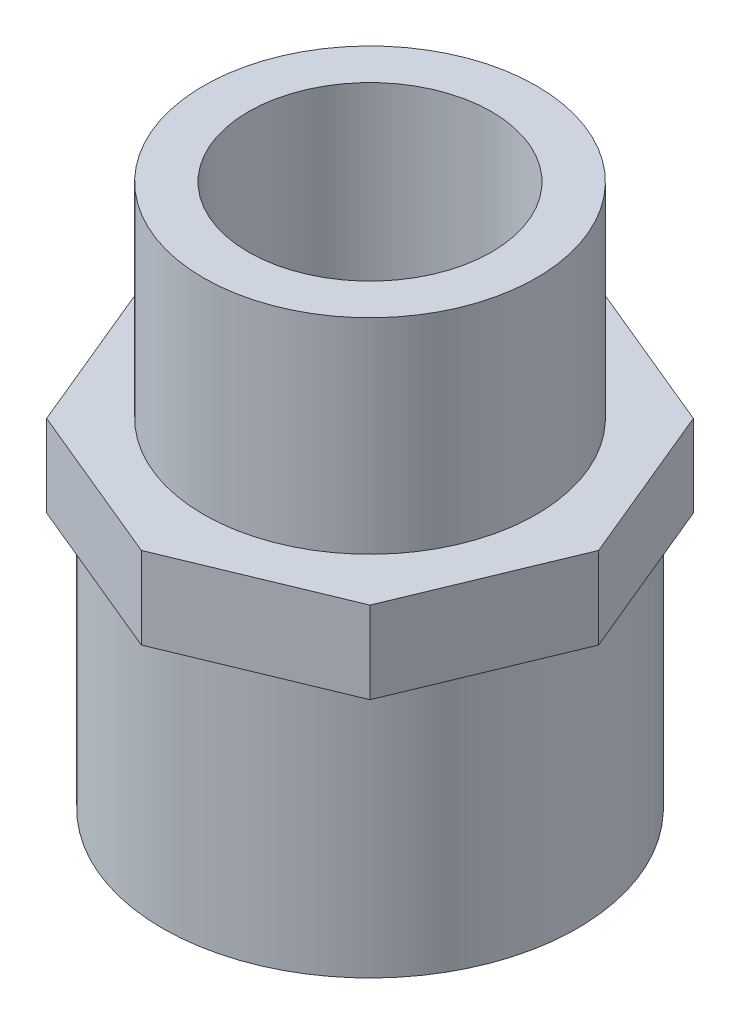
from build123d import *

# Parameters (mm, degrees)
SKETCH1_R           = 12.065
BOSS_EXTRUDE1_DEPTH = 8.128
SKETCH2_R           = 20.574
SKETCH2_R_2         = 16.637
BOSS_EXTRUDE2_DEPTH = 25.4
SKETCH3_R           = 16.51
SKETCH3_R_2         = 12.065
BOSS_EXTRUDE3_DEPTH = 20.32


with BuildPart() as part:
    # Sketch1 → Boss-Extrude1 (new body)
    with BuildSketch(Plane(origin=(0, 0, 0), x_dir=(1, 0, 0), z_dir=(0, 1, 0))):
        Polygon((22.681528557, 0), (16.03826265, 16.03826265), (0, 22.681528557), (-16.03826265, 16.03826265), (-22.681528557, 0), (-16.03826265, -16.03826265), (0, -22.681528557), (16.03826265, -16.03826265), align=None)
        with Locations(Location((0, 0, 0), (0, 0, 270))):
            Circle(SKETCH1_R, mode=Mode.SUBTRACT)
    extrude(amount=BOSS_EXTRUDE1_DEPTH)

    # Sketch2 → Boss-Extrude2 (add)
    with BuildSketch(Plane.XZ):
        with Locations(Location((0, 0, 0), (0, 0, 90))):
            Circle(SKETCH2_R)
        with Locations(Location((0, 0, 0), (0, 0, 270))):
            Circle(SKETCH2_R_2, mode=Mode.SUBTRACT)
    extrude(amount=BOSS_EXTRUDE2_DEPTH)

    # Sketch3 → Boss-Extrude3 (add)
    with BuildSketch(Plane(origin=(0, 8.128, 0), x_dir=(1, 0, 0), z_dir=(0, 1, 0))):
        with Locations(Location((0, 0, 0), (0, 0, 270))):
            Circle(SKETCH3_R)
        with Locations(Location((0, 0, 0), (0, 0, 270))):
            Circle(SKETCH3_R_2, mode=Mode.SUBTRACT)
    extrude(amount=BOSS_EXTRUDE3_DEPTH)


solid = part.part
